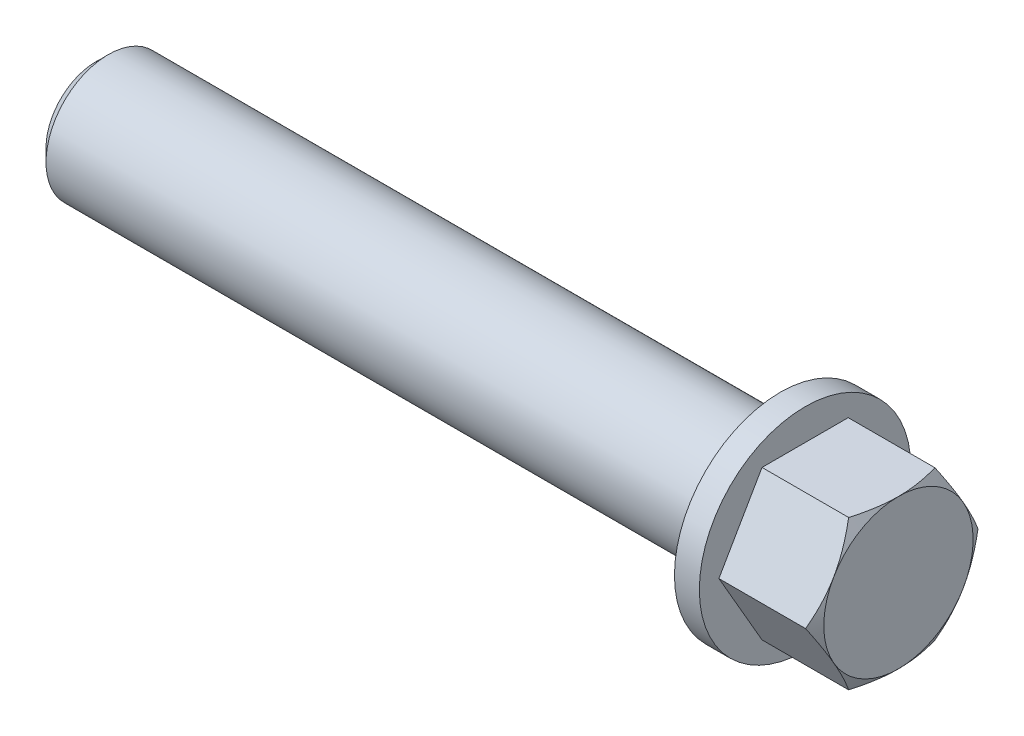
from build123d import *

# Parameters (mm, degrees)
BASE_EXTRUSION_DEPTH = 7.5
ESQUISSE2_R          = 5
BOSS_EXTRU_1_DEPTH   = 57
CHANFREIN1_SIZE      = 1
ESQUISSE4_W          = 2
ESQUISSE4_H          = 8.5
ESQUISSE5_W          = 34
ESQUISSE5_H          = 5


with BuildPart() as part:
    # Esquisse1 → Base-Extrusion (new body)
    with BuildSketch(Plane(origin=(0, 0, 0), x_dir=(0, 0, -1), z_dir=(1, 0, 0))):
        Polygon((6.92820323, 0), (3.464101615, 6), (-3.464101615, 6), (-6.92820323, 0), (-3.464101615, -6), (3.464101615, -6), align=None)
    extrude(amount=BASE_EXTRUSION_DEPTH)

    # Esquisse2 → Boss.-Extru.1 (add)
    with BuildSketch(Plane.ZY):
        with Locations(Location((0, 0, 0), (0, 0, 180))):
            Circle(ESQUISSE2_R)
    extrude(amount=BOSS_EXTRU_1_DEPTH)

    # Esquisse3 → Enl_vement de mati_re-R_volution1 (revolve, cut)
    with BuildSketch(Plane.XY):
        Polygon((7.5, -6), (0, -18.990381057), (7.5, -18.990381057), align=None)
    revolve(axis=Axis((0, 0, 0), (1, 0, 0)), mode=Mode.SUBTRACT)

    # Chanfrein1
    chanfrein1_edges = [part.edges().sort_by_distance(p)[0] for p in [
        (-57, 0, 5),
    ]]
    chamfer(chanfrein1_edges, length=CHANFREIN1_SIZE)

    # Esquisse4 → R_volution1 (revolve)
    with BuildSketch(Plane.XY, mode=Mode.PRIVATE) as r_volution1_sk:
        with Locations((-1, 4.25)):
            Rectangle(ESQUISSE4_W, ESQUISSE4_H)
    revolve(r_volution1_sk.sketch.rotate(Axis((0, 0, 0), (-1, 0, 0)), 90), axis=Axis((0, 0, 0), (-1, 0, 0)))

    # Esquisse5 → R_volution2 (revolve)
    with BuildSketch(Plane.XY):
        with Locations((-19, 2.5)):
            Rectangle(ESQUISSE5_W, ESQUISSE5_H)
    revolve(axis=Axis((0, 0, 0), (-1, 0, 0)))


solid = part.part
